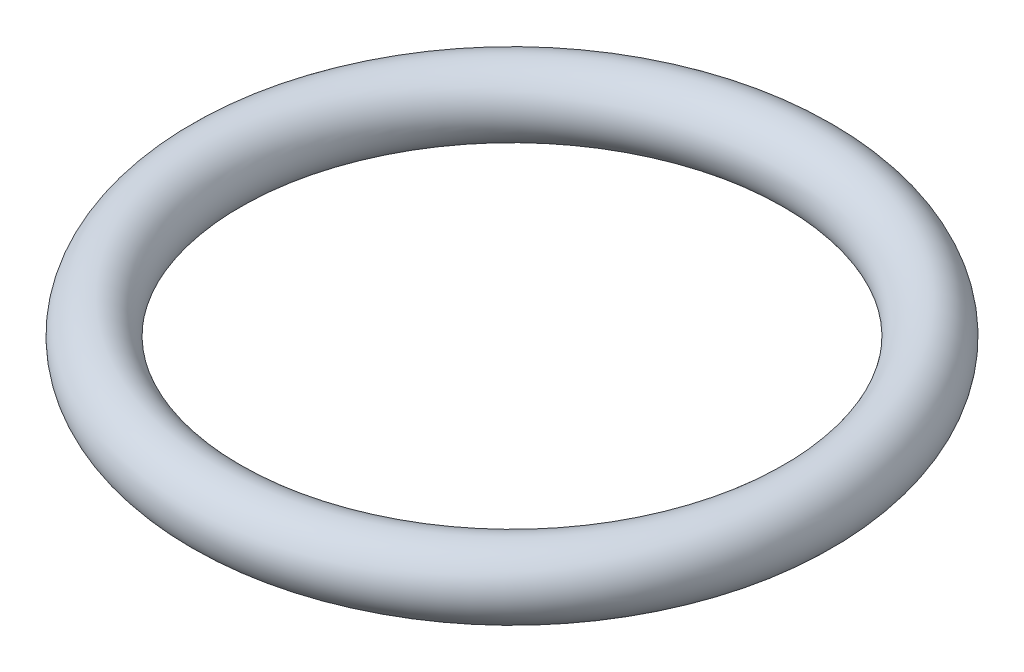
ISO-10303-21;
HEADER;
FILE_DESCRIPTION(('STEP AP214'),'2;1');
FILE_NAME('part.step','',(''),(''),'','','');
FILE_SCHEMA(('AUTOMOTIVE_DESIGN { 1 0 10303 214 1 1 1 1 }'));
ENDSEC;
DATA;
#1=APPLICATION_CONTEXT('core data for automotive mechanical design processes');
#2=APPLICATION_PROTOCOL_DEFINITION('international standard','automotive_design',2000,#1);
#3=PRODUCT_CONTEXT('',#1,'mechanical');
#4=PRODUCT('Part','Part','',(#3));
#5=PRODUCT_RELATED_PRODUCT_CATEGORY('part','',(#4));
#6=PRODUCT_DEFINITION_FORMATION('','',#4);
#7=PRODUCT_DEFINITION_CONTEXT('part definition',#1,'design');
#8=PRODUCT_DEFINITION('design','',#6,#7);
#9=PRODUCT_DEFINITION_SHAPE('','',#8);
#10=(LENGTH_UNIT() NAMED_UNIT(*) SI_UNIT(.MILLI.,.METRE.));
#11=(NAMED_UNIT(*) PLANE_ANGLE_UNIT() SI_UNIT($,.RADIAN.));
#12=(NAMED_UNIT(*) SI_UNIT($,.STERADIAN.) SOLID_ANGLE_UNIT());
#13=UNCERTAINTY_MEASURE_WITH_UNIT(LENGTH_MEASURE(1.E-05),#10,'distance_accuracy_value','');
#14=(GEOMETRIC_REPRESENTATION_CONTEXT(3) GLOBAL_UNCERTAINTY_ASSIGNED_CONTEXT((#13)) GLOBAL_UNIT_ASSIGNED_CONTEXT((#10,
#11,#12)) REPRESENTATION_CONTEXT('',''));
#15=CARTESIAN_POINT('',(0.,0.,0.));
#16=DIRECTION('',(0.,0.,1.));
#17=DIRECTION('',(1.,0.,0.));
#18=AXIS2_PLACEMENT_3D('',#15,#16,#17);
#19=CARTESIAN_POINT('',(0.,0.,0.));
#20=DIRECTION('',(0.,1.,0.));
#21=DIRECTION('',(0.,0.,1.));
#22=AXIS2_PLACEMENT_3D('',#19,#20,#21);
#23=TOROIDAL_SURFACE('',#22,4.35,0.500000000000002);
#24=CARTESIAN_POINT('',(0.,0.,4.85000000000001));
#25=VERTEX_POINT('',#24);
#26=VERTEX_LOOP('',#25);
#27=FACE_BOUND('',#26,.T.);
#28=ADVANCED_FACE('F27',(#27),#23,.T.);
#29=CLOSED_SHELL('',(#28));
#30=MANIFOLD_SOLID_BREP('B2',#29);
#31=ADVANCED_BREP_SHAPE_REPRESENTATION('',(#18,#30),#14);
#32=SHAPE_DEFINITION_REPRESENTATION(#9,#31);
ENDSEC;
END-ISO-10303-21;
